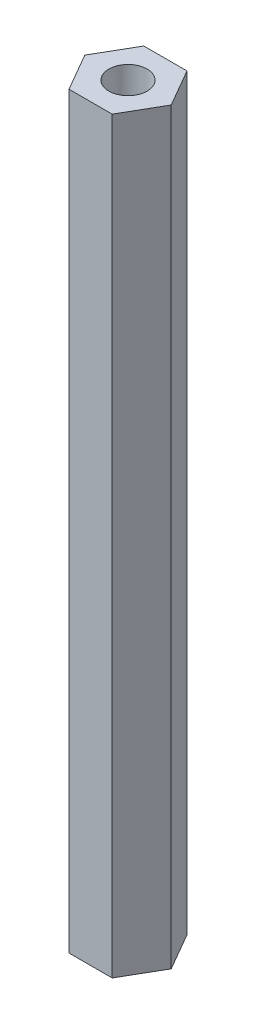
ISO-10303-21;
HEADER;
FILE_DESCRIPTION(('STEP AP214'),'2;1');
FILE_NAME('part.step','',(''),(''),'','','');
FILE_SCHEMA(('AUTOMOTIVE_DESIGN { 1 0 10303 214 1 1 1 1 }'));
ENDSEC;
DATA;
#1=APPLICATION_CONTEXT('core data for automotive mechanical design processes');
#2=APPLICATION_PROTOCOL_DEFINITION('international standard','automotive_design',2000,#1);
#3=PRODUCT_CONTEXT('',#1,'mechanical');
#4=PRODUCT('Part','Part','',(#3));
#5=PRODUCT_RELATED_PRODUCT_CATEGORY('part','',(#4));
#6=PRODUCT_DEFINITION_FORMATION('','',#4);
#7=PRODUCT_DEFINITION_CONTEXT('part definition',#1,'design');
#8=PRODUCT_DEFINITION('design','',#6,#7);
#9=PRODUCT_DEFINITION_SHAPE('','',#8);
#10=(LENGTH_UNIT() NAMED_UNIT(*) SI_UNIT(.MILLI.,.METRE.));
#11=(NAMED_UNIT(*) PLANE_ANGLE_UNIT() SI_UNIT($,.RADIAN.));
#12=(NAMED_UNIT(*) SI_UNIT($,.STERADIAN.) SOLID_ANGLE_UNIT());
#13=UNCERTAINTY_MEASURE_WITH_UNIT(LENGTH_MEASURE(1.E-05),#10,'distance_accuracy_value','');
#14=(GEOMETRIC_REPRESENTATION_CONTEXT(3) GLOBAL_UNCERTAINTY_ASSIGNED_CONTEXT((#13)) GLOBAL_UNIT_ASSIGNED_CONTEXT((#10,
#11,#12)) REPRESENTATION_CONTEXT('',''));
#15=CARTESIAN_POINT('',(0.,0.,0.));
#16=DIRECTION('',(0.,0.,1.));
#17=DIRECTION('',(1.,0.,0.));
#18=AXIS2_PLACEMENT_3D('',#15,#16,#17);
#19=CARTESIAN_POINT('',(0.,63.5,0.));
#20=DIRECTION('',(0.,1.,0.));
#21=DIRECTION('',(0.,0.,1.));
#22=AXIS2_PLACEMENT_3D('',#19,#20,#21);
#23=PLANE('',#22);
#24=DIRECTION('',(-0.500000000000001,0.,-0.866025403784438));
#25=VECTOR('',#24,1.);
#26=CARTESIAN_POINT('',(3.66617420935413,63.5,0.));
#27=LINE('',#26,#25);
#28=CARTESIAN_POINT('',(3.66617420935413,63.5,0.));
#29=VERTEX_POINT('',#28);
#30=CARTESIAN_POINT('',(1.83308710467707,63.5,-3.175));
#31=VERTEX_POINT('',#30);
#32=EDGE_CURVE('E128',#29,#31,#27,.T.);
#33=ORIENTED_EDGE('',*,*,#32,.T.);
#34=DIRECTION('',(-1.,0.,0.));
#35=VECTOR('',#34,1.);
#36=CARTESIAN_POINT('',(1.83308710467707,63.5,-3.175));
#37=LINE('',#36,#35);
#38=CARTESIAN_POINT('',(-1.83308710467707,63.5,-3.175));
#39=VERTEX_POINT('',#38);
#40=EDGE_CURVE('E86',#31,#39,#37,.T.);
#41=ORIENTED_EDGE('',*,*,#40,.T.);
#42=DIRECTION('',(-0.500000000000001,0.,0.866025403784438));
#43=VECTOR('',#42,1.);
#44=CARTESIAN_POINT('',(-1.83308710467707,63.5,-3.175));
#45=LINE('',#44,#43);
#46=CARTESIAN_POINT('',(-3.66617420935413,63.5,0.));
#47=VERTEX_POINT('',#46);
#48=EDGE_CURVE('E99',#39,#47,#45,.T.);
#49=ORIENTED_EDGE('',*,*,#48,.T.);
#50=DIRECTION('',(0.5,0.,0.866025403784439));
#51=VECTOR('',#50,1.);
#52=CARTESIAN_POINT('',(-3.66617420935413,63.5,0.));
#53=LINE('',#52,#51);
#54=CARTESIAN_POINT('',(-1.83308710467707,63.5,3.175));
#55=VERTEX_POINT('',#54);
#56=EDGE_CURVE('E93',#47,#55,#53,.T.);
#57=ORIENTED_EDGE('',*,*,#56,.T.);
#58=DIRECTION('',(1.,0.,0.));
#59=VECTOR('',#58,1.);
#60=CARTESIAN_POINT('',(-1.83308710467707,63.5,3.175));
#61=LINE('',#60,#59);
#62=CARTESIAN_POINT('',(1.83308710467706,63.5,3.175));
#63=VERTEX_POINT('',#62);
#64=EDGE_CURVE('E97',#55,#63,#61,.T.);
#65=ORIENTED_EDGE('',*,*,#64,.T.);
#66=DIRECTION('',(0.500000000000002,0.,-0.866025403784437));
#67=VECTOR('',#66,1.);
#68=CARTESIAN_POINT('',(1.83308710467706,63.5,3.175));
#69=LINE('',#68,#67);
#70=EDGE_CURVE('E49',#63,#29,#69,.T.);
#71=ORIENTED_EDGE('',*,*,#70,.T.);
#72=EDGE_LOOP('',(#33,#41,#49,#57,#65,#71));
#73=FACE_BOUND('',#72,.T.);
#74=CARTESIAN_POINT('',(0.,63.5,0.));
#75=DIRECTION('',(0.,1.,0.));
#76=DIRECTION('',(0.,0.,1.));
#77=AXIS2_PLACEMENT_3D('',#74,#75,#76);
#78=CIRCLE('',#77,1.6256);
#79=CARTESIAN_POINT('',(0.,63.5,1.6256));
#80=VERTEX_POINT('',#79);
#81=EDGE_CURVE('E121',#80,#80,#78,.T.);
#82=ORIENTED_EDGE('',*,*,#81,.F.);
#83=EDGE_LOOP('',(#82));
#84=FACE_BOUND('',#83,.T.);
#85=ADVANCED_FACE('F32',(#73,#84),#23,.T.);
#86=CARTESIAN_POINT('',(0.,0.,0.));
#87=DIRECTION('',(0.,1.,0.));
#88=DIRECTION('',(0.,0.,1.));
#89=AXIS2_PLACEMENT_3D('',#86,#87,#88);
#90=PLANE('',#89);
#91=DIRECTION('',(-0.500000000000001,0.,-0.866025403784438));
#92=VECTOR('',#91,1.);
#93=CARTESIAN_POINT('',(3.66617420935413,0.,0.));
#94=LINE('',#93,#92);
#95=CARTESIAN_POINT('',(3.66617420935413,0.,0.));
#96=VERTEX_POINT('',#95);
#97=CARTESIAN_POINT('',(1.83308710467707,0.,-3.175));
#98=VERTEX_POINT('',#97);
#99=EDGE_CURVE('E117',#96,#98,#94,.T.);
#100=ORIENTED_EDGE('',*,*,#99,.F.);
#101=DIRECTION('',(0.500000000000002,0.,-0.866025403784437));
#102=VECTOR('',#101,1.);
#103=CARTESIAN_POINT('',(1.83308710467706,0.,3.175));
#104=LINE('',#103,#102);
#105=CARTESIAN_POINT('',(1.83308710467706,0.,3.175));
#106=VERTEX_POINT('',#105);
#107=EDGE_CURVE('E78',#106,#96,#104,.T.);
#108=ORIENTED_EDGE('',*,*,#107,.F.);
#109=DIRECTION('',(1.,0.,0.));
#110=VECTOR('',#109,1.);
#111=CARTESIAN_POINT('',(-1.83308710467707,0.,3.175));
#112=LINE('',#111,#110);
#113=CARTESIAN_POINT('',(-1.83308710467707,0.,3.175));
#114=VERTEX_POINT('',#113);
#115=EDGE_CURVE('E72',#114,#106,#112,.T.);
#116=ORIENTED_EDGE('',*,*,#115,.F.);
#117=DIRECTION('',(0.5,0.,0.866025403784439));
#118=VECTOR('',#117,1.);
#119=CARTESIAN_POINT('',(-3.66617420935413,0.,0.));
#120=LINE('',#119,#118);
#121=CARTESIAN_POINT('',(-3.66617420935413,0.,0.));
#122=VERTEX_POINT('',#121);
#123=EDGE_CURVE('E107',#122,#114,#120,.T.);
#124=ORIENTED_EDGE('',*,*,#123,.F.);
#125=DIRECTION('',(-0.500000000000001,0.,0.866025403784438));
#126=VECTOR('',#125,1.);
#127=CARTESIAN_POINT('',(-1.83308710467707,0.,-3.175));
#128=LINE('',#127,#126);
#129=CARTESIAN_POINT('',(-1.83308710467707,0.,-3.175));
#130=VERTEX_POINT('',#129);
#131=EDGE_CURVE('E123',#130,#122,#128,.T.);
#132=ORIENTED_EDGE('',*,*,#131,.F.);
#133=DIRECTION('',(-1.,0.,0.));
#134=VECTOR('',#133,1.);
#135=CARTESIAN_POINT('',(1.83308710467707,0.,-3.175));
#136=LINE('',#135,#134);
#137=EDGE_CURVE('E120',#98,#130,#136,.T.);
#138=ORIENTED_EDGE('',*,*,#137,.F.);
#139=EDGE_LOOP('',(#100,#108,#116,#124,#132,#138));
#140=FACE_BOUND('',#139,.T.);
#141=CARTESIAN_POINT('',(0.,0.,0.));
#142=DIRECTION('',(0.,1.,0.));
#143=DIRECTION('',(0.,0.,1.));
#144=AXIS2_PLACEMENT_3D('',#141,#142,#143);
#145=CIRCLE('',#144,1.6256);
#146=CARTESIAN_POINT('',(0.,0.,1.6256));
#147=VERTEX_POINT('',#146);
#148=EDGE_CURVE('E221',#147,#147,#145,.T.);
#149=ORIENTED_EDGE('',*,*,#148,.T.);
#150=EDGE_LOOP('',(#149));
#151=FACE_BOUND('',#150,.T.);
#152=ADVANCED_FACE('F137',(#140,#151),#90,.F.);
#153=CARTESIAN_POINT('',(3.66617420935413,63.5,0.));
#154=DIRECTION('',(-0.866025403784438,0.,0.500000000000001));
#155=DIRECTION('',(0.500000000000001,0.,0.866025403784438));
#156=AXIS2_PLACEMENT_3D('',#153,#154,#155);
#157=PLANE('',#156);
#158=ORIENTED_EDGE('',*,*,#99,.T.);
#159=DIRECTION('',(0.,-1.,0.));
#160=VECTOR('',#159,1.);
#161=CARTESIAN_POINT('',(1.83308710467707,63.5,-3.175));
#162=LINE('',#161,#160);
#163=EDGE_CURVE('E11',#31,#98,#162,.T.);
#164=ORIENTED_EDGE('',*,*,#163,.F.);
#165=ORIENTED_EDGE('',*,*,#32,.F.);
#166=DIRECTION('',(0.,-1.,0.));
#167=VECTOR('',#166,1.);
#168=CARTESIAN_POINT('',(3.66617420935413,63.5,0.));
#169=LINE('',#168,#167);
#170=EDGE_CURVE('E113',#29,#96,#169,.T.);
#171=ORIENTED_EDGE('',*,*,#170,.T.);
#172=EDGE_LOOP('',(#158,#164,#165,#171));
#173=FACE_BOUND('',#172,.T.);
#174=ADVANCED_FACE('F34',(#173),#157,.F.);
#175=CARTESIAN_POINT('',(1.83308710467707,63.5,-3.175));
#176=DIRECTION('',(0.,0.,1.));
#177=DIRECTION('',(1.,0.,0.));
#178=AXIS2_PLACEMENT_3D('',#175,#176,#177);
#179=PLANE('',#178);
#180=ORIENTED_EDGE('',*,*,#137,.T.);
#181=DIRECTION('',(0.,-1.,0.));
#182=VECTOR('',#181,1.);
#183=CARTESIAN_POINT('',(-1.83308710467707,63.5,-3.175));
#184=LINE('',#183,#182);
#185=EDGE_CURVE('E41',#39,#130,#184,.T.);
#186=ORIENTED_EDGE('',*,*,#185,.F.);
#187=ORIENTED_EDGE('',*,*,#40,.F.);
#188=ORIENTED_EDGE('',*,*,#163,.T.);
#189=EDGE_LOOP('',(#180,#186,#187,#188));
#190=FACE_BOUND('',#189,.T.);
#191=ADVANCED_FACE('F162',(#190),#179,.F.);
#192=CARTESIAN_POINT('',(-1.83308710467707,63.5,-3.175));
#193=DIRECTION('',(0.866025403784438,0.,0.500000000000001));
#194=DIRECTION('',(0.500000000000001,0.,-0.866025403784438));
#195=AXIS2_PLACEMENT_3D('',#192,#193,#194);
#196=PLANE('',#195);
#197=ORIENTED_EDGE('',*,*,#131,.T.);
#198=DIRECTION('',(0.,-1.,0.));
#199=VECTOR('',#198,1.);
#200=CARTESIAN_POINT('',(-3.66617420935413,63.5,0.));
#201=LINE('',#200,#199);
#202=EDGE_CURVE('E108',#47,#122,#201,.T.);
#203=ORIENTED_EDGE('',*,*,#202,.F.);
#204=ORIENTED_EDGE('',*,*,#48,.F.);
#205=ORIENTED_EDGE('',*,*,#185,.T.);
#206=EDGE_LOOP('',(#197,#203,#204,#205));
#207=FACE_BOUND('',#206,.T.);
#208=ADVANCED_FACE('F134',(#207),#196,.F.);
#209=CARTESIAN_POINT('',(-3.66617420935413,63.5,0.));
#210=DIRECTION('',(0.866025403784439,0.,-0.5));
#211=DIRECTION('',(-0.5,0.,-0.866025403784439));
#212=AXIS2_PLACEMENT_3D('',#209,#210,#211);
#213=PLANE('',#212);
#214=ORIENTED_EDGE('',*,*,#123,.T.);
#215=DIRECTION('',(0.,-1.,0.));
#216=VECTOR('',#215,1.);
#217=CARTESIAN_POINT('',(-1.83308710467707,63.5,3.175));
#218=LINE('',#217,#216);
#219=EDGE_CURVE('E104',#55,#114,#218,.T.);
#220=ORIENTED_EDGE('',*,*,#219,.F.);
#221=ORIENTED_EDGE('',*,*,#56,.F.);
#222=ORIENTED_EDGE('',*,*,#202,.T.);
#223=EDGE_LOOP('',(#214,#220,#221,#222));
#224=FACE_BOUND('',#223,.T.);
#225=ADVANCED_FACE('F105',(#224),#213,.F.);
#226=CARTESIAN_POINT('',(-1.83308710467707,63.5,3.175));
#227=DIRECTION('',(0.,0.,-1.));
#228=DIRECTION('',(-1.,0.,0.));
#229=AXIS2_PLACEMENT_3D('',#226,#227,#228);
#230=PLANE('',#229);
#231=ORIENTED_EDGE('',*,*,#115,.T.);
#232=DIRECTION('',(0.,-1.,0.));
#233=VECTOR('',#232,1.);
#234=CARTESIAN_POINT('',(1.83308710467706,63.5,3.175));
#235=LINE('',#234,#233);
#236=EDGE_CURVE('E109',#63,#106,#235,.T.);
#237=ORIENTED_EDGE('',*,*,#236,.F.);
#238=ORIENTED_EDGE('',*,*,#64,.F.);
#239=ORIENTED_EDGE('',*,*,#219,.T.);
#240=EDGE_LOOP('',(#231,#237,#238,#239));
#241=FACE_BOUND('',#240,.T.);
#242=ADVANCED_FACE('F111',(#241),#230,.F.);
#243=CARTESIAN_POINT('',(1.83308710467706,63.5,3.175));
#244=DIRECTION('',(-0.866025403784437,0.,-0.500000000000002));
#245=DIRECTION('',(-0.500000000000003,0.,0.866025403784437));
#246=AXIS2_PLACEMENT_3D('',#243,#244,#245);
#247=PLANE('',#246);
#248=ORIENTED_EDGE('',*,*,#107,.T.);
#249=ORIENTED_EDGE('',*,*,#170,.F.);
#250=ORIENTED_EDGE('',*,*,#70,.F.);
#251=ORIENTED_EDGE('',*,*,#236,.T.);
#252=EDGE_LOOP('',(#248,#249,#250,#251));
#253=FACE_BOUND('',#252,.T.);
#254=ADVANCED_FACE('F142',(#253),#247,.F.);
#255=CARTESIAN_POINT('',(0.,63.5,0.));
#256=DIRECTION('',(0.,-1.,0.));
#257=DIRECTION('',(0.,0.,-1.));
#258=AXIS2_PLACEMENT_3D('',#255,#256,#257);
#259=CYLINDRICAL_SURFACE('',#258,1.6256);
#260=ORIENTED_EDGE('',*,*,#81,.T.);
#261=EDGE_LOOP('',(#260));
#262=FACE_BOUND('',#261,.T.);
#263=ORIENTED_EDGE('',*,*,#148,.F.);
#264=EDGE_LOOP('',(#263));
#265=FACE_BOUND('',#264,.T.);
#266=ADVANCED_FACE('F144',(#262,#265),#259,.F.);
#267=CLOSED_SHELL('',(#85,#152,#174,#191,#208,#225,#242,#254,#266));
#268=MANIFOLD_SOLID_BREP('B2',#267);
#269=ADVANCED_BREP_SHAPE_REPRESENTATION('',(#18,#268),#14);
#270=SHAPE_DEFINITION_REPRESENTATION(#9,#269);
ENDSEC;
END-ISO-10303-21;
